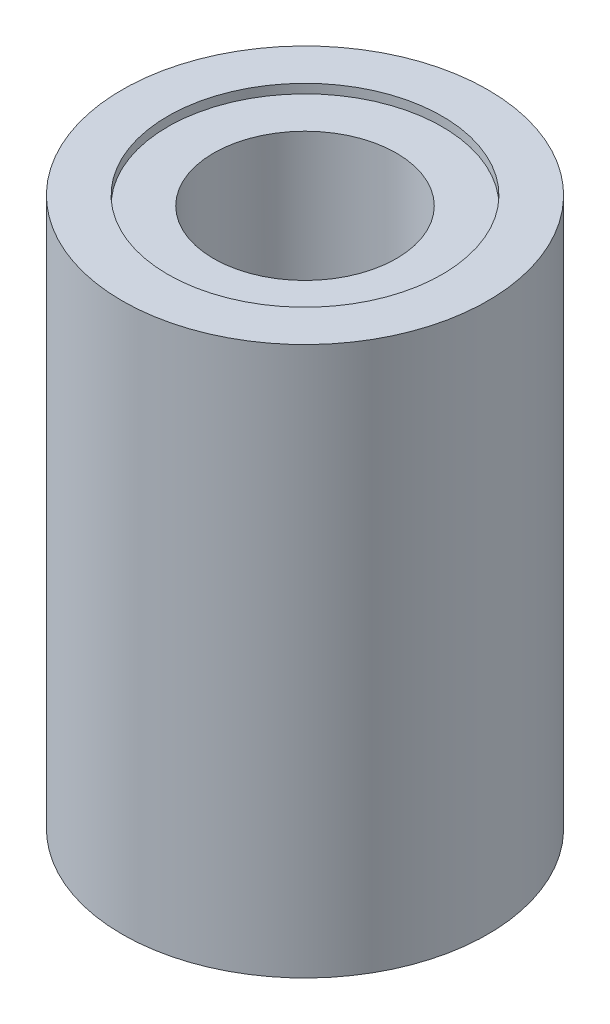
ISO-10303-21;
HEADER;
FILE_DESCRIPTION(('STEP AP214'),'2;1');
FILE_NAME('part.step','',(''),(''),'','','');
FILE_SCHEMA(('AUTOMOTIVE_DESIGN { 1 0 10303 214 1 1 1 1 }'));
ENDSEC;
DATA;
#1=APPLICATION_CONTEXT('core data for automotive mechanical design processes');
#2=APPLICATION_PROTOCOL_DEFINITION('international standard','automotive_design',2000,#1);
#3=PRODUCT_CONTEXT('',#1,'mechanical');
#4=PRODUCT('Part','Part','',(#3));
#5=PRODUCT_RELATED_PRODUCT_CATEGORY('part','',(#4));
#6=PRODUCT_DEFINITION_FORMATION('','',#4);
#7=PRODUCT_DEFINITION_CONTEXT('part definition',#1,'design');
#8=PRODUCT_DEFINITION('design','',#6,#7);
#9=PRODUCT_DEFINITION_SHAPE('','',#8);
#10=(LENGTH_UNIT() NAMED_UNIT(*) SI_UNIT(.MILLI.,.METRE.));
#11=(NAMED_UNIT(*) PLANE_ANGLE_UNIT() SI_UNIT($,.RADIAN.));
#12=(NAMED_UNIT(*) SI_UNIT($,.STERADIAN.) SOLID_ANGLE_UNIT());
#13=UNCERTAINTY_MEASURE_WITH_UNIT(LENGTH_MEASURE(1.E-05),#10,'distance_accuracy_value','');
#14=(GEOMETRIC_REPRESENTATION_CONTEXT(3) GLOBAL_UNCERTAINTY_ASSIGNED_CONTEXT((#13)) GLOBAL_UNIT_ASSIGNED_CONTEXT((#10,
#11,#12)) REPRESENTATION_CONTEXT('',''));
#15=CARTESIAN_POINT('',(0.,0.,0.));
#16=DIRECTION('',(0.,0.,1.));
#17=DIRECTION('',(1.,0.,0.));
#18=AXIS2_PLACEMENT_3D('',#15,#16,#17);
#19=CARTESIAN_POINT('',(0.,12.,0.));
#20=DIRECTION('',(0.,-1.,0.));
#21=DIRECTION('',(0.,0.,-1.));
#22=AXIS2_PLACEMENT_3D('',#19,#20,#21);
#23=CYLINDRICAL_SURFACE('',#22,2.);
#24=CARTESIAN_POINT('',(0.,11.8,0.));
#25=DIRECTION('',(0.,1.,0.));
#26=DIRECTION('',(0.,0.,1.));
#27=AXIS2_PLACEMENT_3D('',#24,#25,#26);
#28=CIRCLE('',#27,2.);
#29=CARTESIAN_POINT('',(0.,11.8,2.));
#30=VERTEX_POINT('',#29);
#31=EDGE_CURVE('E47',#30,#30,#28,.T.);
#32=ORIENTED_EDGE('',*,*,#31,.T.);
#33=EDGE_LOOP('',(#32));
#34=FACE_BOUND('',#33,.T.);
#35=CARTESIAN_POINT('',(0.,0.2,0.));
#36=DIRECTION('',(0.,-1.,0.));
#37=DIRECTION('',(0.,0.,-1.));
#38=AXIS2_PLACEMENT_3D('',#35,#36,#37);
#39=CIRCLE('',#38,2.);
#40=CARTESIAN_POINT('',(0.,0.2,-2.));
#41=VERTEX_POINT('',#40);
#42=EDGE_CURVE('E56',#41,#41,#39,.T.);
#43=ORIENTED_EDGE('',*,*,#42,.T.);
#44=EDGE_LOOP('',(#43));
#45=FACE_BOUND('',#44,.T.);
#46=ADVANCED_FACE('F31',(#34,#45),#23,.F.);
#47=CARTESIAN_POINT('',(0.,12.,0.));
#48=DIRECTION('',(0.,1.,0.));
#49=DIRECTION('',(0.,0.,1.));
#50=AXIS2_PLACEMENT_3D('',#47,#48,#49);
#51=PLANE('',#50);
#52=CARTESIAN_POINT('',(0.,12.,0.));
#53=DIRECTION('',(0.,1.,0.));
#54=DIRECTION('',(0.,0.,1.));
#55=AXIS2_PLACEMENT_3D('',#52,#53,#54);
#56=CIRCLE('',#55,3.);
#57=CARTESIAN_POINT('',(0.,12.,3.));
#58=VERTEX_POINT('',#57);
#59=EDGE_CURVE('E44',#58,#58,#56,.T.);
#60=ORIENTED_EDGE('',*,*,#59,.F.);
#61=EDGE_LOOP('',(#60));
#62=FACE_BOUND('',#61,.T.);
#63=CARTESIAN_POINT('',(0.,12.,0.));
#64=DIRECTION('',(0.,1.,0.));
#65=DIRECTION('',(0.,0.,1.));
#66=AXIS2_PLACEMENT_3D('',#63,#64,#65);
#67=CIRCLE('',#66,4.);
#68=CARTESIAN_POINT('',(0.,12.,4.));
#69=VERTEX_POINT('',#68);
#70=EDGE_CURVE('E10',#69,#69,#67,.T.);
#71=ORIENTED_EDGE('',*,*,#70,.T.);
#72=EDGE_LOOP('',(#71));
#73=FACE_BOUND('',#72,.T.);
#74=ADVANCED_FACE('F79',(#62,#73),#51,.T.);
#75=CARTESIAN_POINT('',(0.,0.,0.));
#76=DIRECTION('',(0.,1.,0.));
#77=DIRECTION('',(0.,0.,1.));
#78=AXIS2_PLACEMENT_3D('',#75,#76,#77);
#79=PLANE('',#78);
#80=CARTESIAN_POINT('',(0.,0.,0.));
#81=DIRECTION('',(0.,-1.,0.));
#82=DIRECTION('',(0.,0.,-1.));
#83=AXIS2_PLACEMENT_3D('',#80,#81,#82);
#84=CIRCLE('',#83,3.);
#85=CARTESIAN_POINT('',(0.,0.,-3.));
#86=VERTEX_POINT('',#85);
#87=EDGE_CURVE('E53',#86,#86,#84,.T.);
#88=ORIENTED_EDGE('',*,*,#87,.F.);
#89=EDGE_LOOP('',(#88));
#90=FACE_BOUND('',#89,.T.);
#91=CARTESIAN_POINT('',(0.,0.,0.));
#92=DIRECTION('',(0.,1.,0.));
#93=DIRECTION('',(0.,0.,1.));
#94=AXIS2_PLACEMENT_3D('',#91,#92,#93);
#95=CIRCLE('',#94,4.);
#96=CARTESIAN_POINT('',(0.,0.,4.));
#97=VERTEX_POINT('',#96);
#98=EDGE_CURVE('E35',#97,#97,#95,.T.);
#99=ORIENTED_EDGE('',*,*,#98,.F.);
#100=EDGE_LOOP('',(#99));
#101=FACE_BOUND('',#100,.T.);
#102=ADVANCED_FACE('F76',(#90,#101),#79,.F.);
#103=CARTESIAN_POINT('',(0.,12.,0.));
#104=DIRECTION('',(0.,-1.,0.));
#105=DIRECTION('',(0.,0.,-1.));
#106=AXIS2_PLACEMENT_3D('',#103,#104,#105);
#107=CYLINDRICAL_SURFACE('',#106,4.);
#108=ORIENTED_EDGE('',*,*,#70,.F.);
#109=EDGE_LOOP('',(#108));
#110=FACE_BOUND('',#109,.T.);
#111=ORIENTED_EDGE('',*,*,#98,.T.);
#112=EDGE_LOOP('',(#111));
#113=FACE_BOUND('',#112,.T.);
#114=ADVANCED_FACE('F33',(#110,#113),#107,.T.);
#115=CARTESIAN_POINT('',(0.,11.8,0.));
#116=DIRECTION('',(0.,1.,0.));
#117=DIRECTION('',(0.,0.,1.));
#118=AXIS2_PLACEMENT_3D('',#115,#116,#117);
#119=CYLINDRICAL_SURFACE('',#118,3.);
#120=CARTESIAN_POINT('',(0.,11.8,0.));
#121=DIRECTION('',(0.,1.,0.));
#122=DIRECTION('',(0.,0.,1.));
#123=AXIS2_PLACEMENT_3D('',#120,#121,#122);
#124=CIRCLE('',#123,3.);
#125=CARTESIAN_POINT('',(0.,11.8,3.));
#126=VERTEX_POINT('',#125);
#127=EDGE_CURVE('E42',#126,#126,#124,.T.);
#128=ORIENTED_EDGE('',*,*,#127,.F.);
#129=EDGE_LOOP('',(#128));
#130=FACE_BOUND('',#129,.T.);
#131=ORIENTED_EDGE('',*,*,#59,.T.);
#132=EDGE_LOOP('',(#131));
#133=FACE_BOUND('',#132,.T.);
#134=ADVANCED_FACE('F83',(#130,#133),#119,.F.);
#135=CARTESIAN_POINT('',(0.,11.8,0.));
#136=DIRECTION('',(0.,1.,0.));
#137=DIRECTION('',(0.,0.,1.));
#138=AXIS2_PLACEMENT_3D('',#135,#136,#137);
#139=PLANE('',#138);
#140=ORIENTED_EDGE('',*,*,#31,.F.);
#141=EDGE_LOOP('',(#140));
#142=FACE_BOUND('',#141,.T.);
#143=ORIENTED_EDGE('',*,*,#127,.T.);
#144=EDGE_LOOP('',(#143));
#145=FACE_BOUND('',#144,.T.);
#146=ADVANCED_FACE('F72',(#142,#145),#139,.T.);
#147=CARTESIAN_POINT('',(0.,0.2,0.));
#148=DIRECTION('',(0.,-1.,0.));
#149=DIRECTION('',(0.,0.,-1.));
#150=AXIS2_PLACEMENT_3D('',#147,#148,#149);
#151=CYLINDRICAL_SURFACE('',#150,3.);
#152=CARTESIAN_POINT('',(0.,0.2,0.));
#153=DIRECTION('',(0.,-1.,0.));
#154=DIRECTION('',(0.,0.,-1.));
#155=AXIS2_PLACEMENT_3D('',#152,#153,#154);
#156=CIRCLE('',#155,3.);
#157=CARTESIAN_POINT('',(0.,0.2,-3.));
#158=VERTEX_POINT('',#157);
#159=EDGE_CURVE('E52',#158,#158,#156,.T.);
#160=ORIENTED_EDGE('',*,*,#159,.F.);
#161=EDGE_LOOP('',(#160));
#162=FACE_BOUND('',#161,.T.);
#163=ORIENTED_EDGE('',*,*,#87,.T.);
#164=EDGE_LOOP('',(#163));
#165=FACE_BOUND('',#164,.T.);
#166=ADVANCED_FACE('F66',(#162,#165),#151,.F.);
#167=CARTESIAN_POINT('',(0.,0.2,0.));
#168=DIRECTION('',(0.,-1.,0.));
#169=DIRECTION('',(0.,0.,-1.));
#170=AXIS2_PLACEMENT_3D('',#167,#168,#169);
#171=PLANE('',#170);
#172=ORIENTED_EDGE('',*,*,#42,.F.);
#173=EDGE_LOOP('',(#172));
#174=FACE_BOUND('',#173,.T.);
#175=ORIENTED_EDGE('',*,*,#159,.T.);
#176=EDGE_LOOP('',(#175));
#177=FACE_BOUND('',#176,.T.);
#178=ADVANCED_FACE('F63',(#174,#177),#171,.T.);
#179=CLOSED_SHELL('',(#46,#74,#102,#114,#134,#146,#166,#178));
#180=MANIFOLD_SOLID_BREP('B2',#179);
#181=ADVANCED_BREP_SHAPE_REPRESENTATION('',(#18,#180),#14);
#182=SHAPE_DEFINITION_REPRESENTATION(#9,#181);
ENDSEC;
END-ISO-10303-21;
